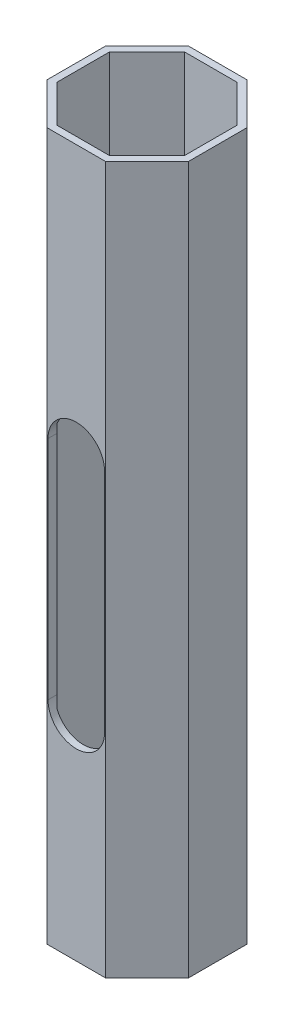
from build123d import *

# Parameters (mm, degrees)
FORME_EXT_RIEURE_DEPTH = 1000
TROU_T                 = -10
VIDEMENT_TRAPPE_REACH  = 1011.95


with BuildPart() as part:
    # Esquisse1 → Forme ext_rieure (new body)
    with BuildSketch(Plane(origin=(0, 0, 0), x_dir=(1, 0, 0), z_dir=(0, 1, 0))):
        Polygon((41.421356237, -100), (100, -41.421356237), (100, 41.421356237), (41.421356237, 100), (-41.421356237, 100), (-100, 41.421356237), (-100, -41.421356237), (-41.421356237, -100), align=None)
    extrude(amount=FORME_EXT_RIEURE_DEPTH)

    # Trou
    trou_openings = [part.faces().sort_by_distance(p)[0] for p in [
        (0, 1000, 0),
        (0, 0, 0),
    ]]
    offset(amount=TROU_T, openings=trou_openings, kind=Kind.INTERSECTION)

    # Esquisse2 → videment trappe (cut, up to next)
    with BuildSketch(Plane.XY, mode=Mode.PRIVATE) as videment_trappe_sk1:
        with BuildLine():
            Line((-40, 300), (-40, 620))
            ThreePointArc((-40, 620), (0, 660), (40, 620))
            Line((40, 620), (40, 300))
            ThreePointArc((40, 300), (0, 260), (-40, 300))
        make_face()
    videment_trappe_tool1 = extrude(videment_trappe_sk1.sketch, amount=VIDEMENT_TRAPPE_REACH, mode=Mode.PRIVATE) & part.part
    add(videment_trappe_tool1.solids().sort_by_distance((0, 460, 0))[0], mode=Mode.SUBTRACT)


solid = part.part
